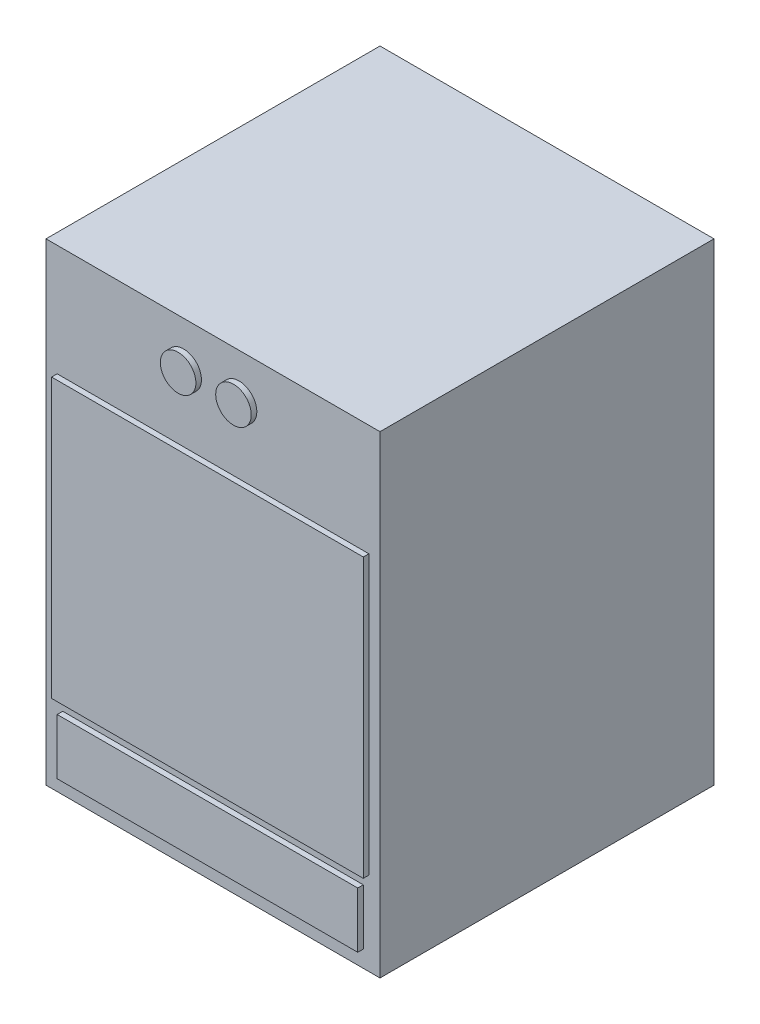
from build123d import *

# Parameters (mm, degrees)
ESQUISSE1_W        = 600
ESQUISSE1_H        = 600
BOSS_EXTRU_1_DEPTH = 850
ESQUISSE3_R        = 31.929504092
BOSS_EXTRU_2_DEPTH = 10
ESQUISSE4_W        = 540
ESQUISSE4_H        = 100
BOSS_EXTRU_3_DEPTH = 10
ESQUISSE5_W        = 560
ESQUISSE5_H        = 500
BOSS_EXTRU_4_DEPTH = 10


with BuildPart() as part:
    # Esquisse1 → Boss.-Extru.1 (new body)
    with BuildSketch(Plane(origin=(0, 0, 0), x_dir=(1, 0, 0), z_dir=(0, 1, 0))):
        Rectangle(ESQUISSE1_W, ESQUISSE1_H)
    extrude(amount=BOSS_EXTRU_1_DEPTH)

    # Esquisse3 → Boss.-Extru.2 (add)
    with BuildSketch(Plane.XY.offset(300)):
        with Locations(Location((-52.701240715, 770.356504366, 0), (0, 0, 180))):
            Circle(ESQUISSE3_R)
        with Locations(Location((46.771445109, 770.356504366, 0), (0, 0, 180))):
            Circle(ESQUISSE3_R)
    extrude(amount=BOSS_EXTRU_2_DEPTH)

    # Esquisse4 → Boss.-Extru.3 (add)
    with BuildSketch(Plane.XY.offset(300)):
        with Locations((0, 80)):
            Rectangle(ESQUISSE4_W, ESQUISSE4_H)
    extrude(amount=BOSS_EXTRU_3_DEPTH)

    # Esquisse5 → Boss.-Extru.4 (add)
    with BuildSketch(Plane.XY.offset(300)):
        with Locations((0, 400)):
            Rectangle(ESQUISSE5_W, ESQUISSE5_H)
    extrude(amount=BOSS_EXTRU_4_DEPTH)


solid = part.part
